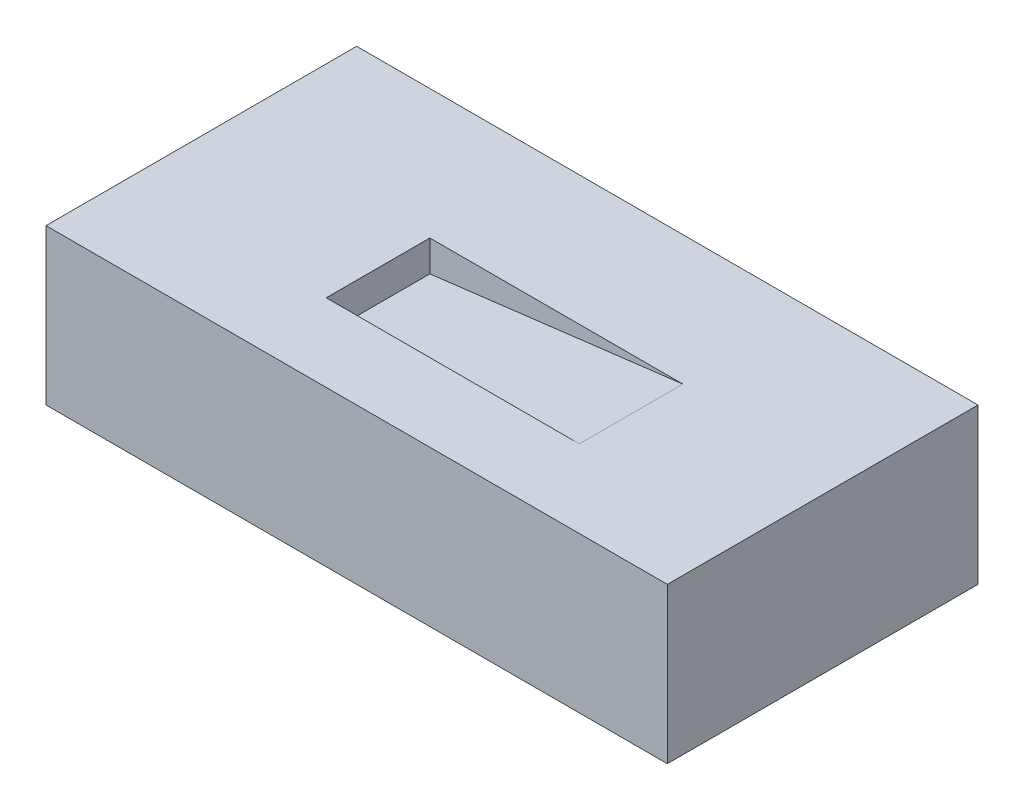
ISO-10303-21;
HEADER;
FILE_DESCRIPTION(('STEP AP214'),'2;1');
FILE_NAME('part.step','',(''),(''),'','','');
FILE_SCHEMA(('AUTOMOTIVE_DESIGN { 1 0 10303 214 1 1 1 1 }'));
ENDSEC;
DATA;
#1=APPLICATION_CONTEXT('core data for automotive mechanical design processes');
#2=APPLICATION_PROTOCOL_DEFINITION('international standard','automotive_design',2000,#1);
#3=PRODUCT_CONTEXT('',#1,'mechanical');
#4=PRODUCT('Part','Part','',(#3));
#5=PRODUCT_RELATED_PRODUCT_CATEGORY('part','',(#4));
#6=PRODUCT_DEFINITION_FORMATION('','',#4);
#7=PRODUCT_DEFINITION_CONTEXT('part definition',#1,'design');
#8=PRODUCT_DEFINITION('design','',#6,#7);
#9=PRODUCT_DEFINITION_SHAPE('','',#8);
#10=(LENGTH_UNIT() NAMED_UNIT(*) SI_UNIT(.MILLI.,.METRE.));
#11=(NAMED_UNIT(*) PLANE_ANGLE_UNIT() SI_UNIT($,.RADIAN.));
#12=(NAMED_UNIT(*) SI_UNIT($,.STERADIAN.) SOLID_ANGLE_UNIT());
#13=UNCERTAINTY_MEASURE_WITH_UNIT(LENGTH_MEASURE(1.E-05),#10,'distance_accuracy_value','');
#14=(GEOMETRIC_REPRESENTATION_CONTEXT(3) GLOBAL_UNCERTAINTY_ASSIGNED_CONTEXT((#13)) GLOBAL_UNIT_ASSIGNED_CONTEXT((#10,
#11,#12)) REPRESENTATION_CONTEXT('',''));
#15=CARTESIAN_POINT('',(0.,0.,0.));
#16=DIRECTION('',(0.,0.,1.));
#17=DIRECTION('',(1.,0.,0.));
#18=AXIS2_PLACEMENT_3D('',#15,#16,#17);
#19=CARTESIAN_POINT('',(0.,0.,-60.));
#20=DIRECTION('',(-1.,0.,0.));
#21=DIRECTION('',(0.,-1.,0.));
#22=AXIS2_PLACEMENT_3D('',#19,#20,#21);
#23=PLANE('',#22);
#24=DIRECTION('',(0.,-1.,0.));
#25=VECTOR('',#24,1.);
#26=CARTESIAN_POINT('',(0.,0.,0.));
#27=LINE('',#26,#25);
#28=CARTESIAN_POINT('',(0.,0.,0.));
#29=VERTEX_POINT('',#28);
#30=CARTESIAN_POINT('',(0.,-30.,0.));
#31=VERTEX_POINT('',#30);
#32=EDGE_CURVE('E128',#29,#31,#27,.T.);
#33=ORIENTED_EDGE('',*,*,#32,.F.);
#34=DIRECTION('',(0.,0.,1.));
#35=VECTOR('',#34,1.);
#36=CARTESIAN_POINT('',(0.,0.,-60.));
#37=LINE('',#36,#35);
#38=CARTESIAN_POINT('',(0.,0.,-60.));
#39=VERTEX_POINT('',#38);
#40=EDGE_CURVE('E11',#39,#29,#37,.T.);
#41=ORIENTED_EDGE('',*,*,#40,.F.);
#42=DIRECTION('',(0.,-1.,0.));
#43=VECTOR('',#42,1.);
#44=CARTESIAN_POINT('',(0.,0.,-60.));
#45=LINE('',#44,#43);
#46=CARTESIAN_POINT('',(0.,-30.,-60.));
#47=VERTEX_POINT('',#46);
#48=EDGE_CURVE('E130',#39,#47,#45,.T.);
#49=ORIENTED_EDGE('',*,*,#48,.T.);
#50=DIRECTION('',(0.,0.,1.));
#51=VECTOR('',#50,1.);
#52=CARTESIAN_POINT('',(0.,-30.,-60.));
#53=LINE('',#52,#51);
#54=EDGE_CURVE('E36',#47,#31,#53,.T.);
#55=ORIENTED_EDGE('',*,*,#54,.T.);
#56=EDGE_LOOP('',(#33,#41,#49,#55));
#57=FACE_BOUND('',#56,.T.);
#58=ADVANCED_FACE('F33',(#57),#23,.T.);
#59=CARTESIAN_POINT('',(0.,0.,-60.));
#60=DIRECTION('',(0.,-1.,0.));
#61=DIRECTION('',(0.,0.,-1.));
#62=AXIS2_PLACEMENT_3D('',#59,#60,#61);
#63=PLANE('',#62);
#64=DIRECTION('',(0.,0.,1.));
#65=VECTOR('',#64,1.);
#66=CARTESIAN_POINT('',(39.1339214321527,0.,-35.));
#67=LINE('',#66,#65);
#68=CARTESIAN_POINT('',(39.1339214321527,0.,-35.));
#69=VERTEX_POINT('',#68);
#70=CARTESIAN_POINT('',(39.1339214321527,0.,-15.));
#71=VERTEX_POINT('',#70);
#72=EDGE_CURVE('E109',#69,#71,#67,.T.);
#73=ORIENTED_EDGE('',*,*,#72,.F.);
#74=DIRECTION('',(-1.,0.,0.));
#75=VECTOR('',#74,1.);
#76=CARTESIAN_POINT('',(-36.3521276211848,0.,-35.));
#77=LINE('',#76,#75);
#78=CARTESIAN_POINT('',(88.,0.,-35.));
#79=VERTEX_POINT('',#78);
#80=EDGE_CURVE('E115',#79,#69,#77,.T.);
#81=ORIENTED_EDGE('',*,*,#80,.F.);
#82=DIRECTION('',(0.,0.,1.));
#83=VECTOR('',#82,1.);
#84=CARTESIAN_POINT('',(88.,0.,-35.));
#85=LINE('',#84,#83);
#86=CARTESIAN_POINT('',(88.,0.,-15.));
#87=VERTEX_POINT('',#86);
#88=EDGE_CURVE('E99',#79,#87,#85,.T.);
#89=ORIENTED_EDGE('',*,*,#88,.T.);
#90=DIRECTION('',(-1.,0.,0.));
#91=VECTOR('',#90,1.);
#92=CARTESIAN_POINT('',(-36.3521276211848,0.,-15.));
#93=LINE('',#92,#91);
#94=EDGE_CURVE('E123',#87,#71,#93,.T.);
#95=ORIENTED_EDGE('',*,*,#94,.T.);
#96=EDGE_LOOP('',(#73,#81,#89,#95));
#97=FACE_BOUND('',#96,.T.);
#98=DIRECTION('',(1.,0.,0.));
#99=VECTOR('',#98,1.);
#100=CARTESIAN_POINT('',(0.,0.,0.));
#101=LINE('',#100,#99);
#102=CARTESIAN_POINT('',(120.,0.,0.));
#103=VERTEX_POINT('',#102);
#104=EDGE_CURVE('E133',#29,#103,#101,.T.);
#105=ORIENTED_EDGE('',*,*,#104,.T.);
#106=DIRECTION('',(0.,0.,1.));
#107=VECTOR('',#106,1.);
#108=CARTESIAN_POINT('',(120.,0.,-60.));
#109=LINE('',#108,#107);
#110=CARTESIAN_POINT('',(120.,0.,-60.));
#111=VERTEX_POINT('',#110);
#112=EDGE_CURVE('E41',#111,#103,#109,.T.);
#113=ORIENTED_EDGE('',*,*,#112,.F.);
#114=DIRECTION('',(1.,0.,0.));
#115=VECTOR('',#114,1.);
#116=CARTESIAN_POINT('',(0.,0.,-60.));
#117=LINE('',#116,#115);
#118=EDGE_CURVE('E137',#39,#111,#117,.T.);
#119=ORIENTED_EDGE('',*,*,#118,.F.);
#120=ORIENTED_EDGE('',*,*,#40,.T.);
#121=EDGE_LOOP('',(#105,#113,#119,#120));
#122=FACE_BOUND('',#121,.T.);
#123=ADVANCED_FACE('F118',(#97,#122),#63,.F.);
#124=CARTESIAN_POINT('',(120.,0.,-60.));
#125=DIRECTION('',(-1.,0.,0.));
#126=DIRECTION('',(0.,-1.,0.));
#127=AXIS2_PLACEMENT_3D('',#124,#125,#126);
#128=PLANE('',#127);
#129=DIRECTION('',(0.,-1.,0.));
#130=VECTOR('',#129,1.);
#131=CARTESIAN_POINT('',(120.,0.,0.));
#132=LINE('',#131,#130);
#133=CARTESIAN_POINT('',(120.,-30.,0.));
#134=VERTEX_POINT('',#133);
#135=EDGE_CURVE('E144',#103,#134,#132,.T.);
#136=ORIENTED_EDGE('',*,*,#135,.T.);
#137=DIRECTION('',(0.,0.,1.));
#138=VECTOR('',#137,1.);
#139=CARTESIAN_POINT('',(120.,-30.,-60.));
#140=LINE('',#139,#138);
#141=CARTESIAN_POINT('',(120.,-30.,-60.));
#142=VERTEX_POINT('',#141);
#143=EDGE_CURVE('E149',#142,#134,#140,.T.);
#144=ORIENTED_EDGE('',*,*,#143,.F.);
#145=DIRECTION('',(0.,-1.,0.));
#146=VECTOR('',#145,1.);
#147=CARTESIAN_POINT('',(120.,0.,-60.));
#148=LINE('',#147,#146);
#149=EDGE_CURVE('E135',#111,#142,#148,.T.);
#150=ORIENTED_EDGE('',*,*,#149,.F.);
#151=ORIENTED_EDGE('',*,*,#112,.T.);
#152=EDGE_LOOP('',(#136,#144,#150,#151));
#153=FACE_BOUND('',#152,.T.);
#154=ADVANCED_FACE('F159',(#153),#128,.F.);
#155=CARTESIAN_POINT('',(0.,-30.,-60.));
#156=DIRECTION('',(0.,-1.,0.));
#157=DIRECTION('',(0.,0.,-1.));
#158=AXIS2_PLACEMENT_3D('',#155,#156,#157);
#159=PLANE('',#158);
#160=DIRECTION('',(1.,0.,0.));
#161=VECTOR('',#160,1.);
#162=CARTESIAN_POINT('',(0.,-30.,0.));
#163=LINE('',#162,#161);
#164=EDGE_CURVE('E141',#31,#134,#163,.T.);
#165=ORIENTED_EDGE('',*,*,#164,.F.);
#166=ORIENTED_EDGE('',*,*,#54,.F.);
#167=DIRECTION('',(1.,0.,0.));
#168=VECTOR('',#167,1.);
#169=CARTESIAN_POINT('',(0.,-30.,-60.));
#170=LINE('',#169,#168);
#171=EDGE_CURVE('E132',#47,#142,#170,.T.);
#172=ORIENTED_EDGE('',*,*,#171,.T.);
#173=ORIENTED_EDGE('',*,*,#143,.T.);
#174=EDGE_LOOP('',(#165,#166,#172,#173));
#175=FACE_BOUND('',#174,.T.);
#176=ADVANCED_FACE('F152',(#175),#159,.T.);
#177=CARTESIAN_POINT('',(0.,-30.,-60.));
#178=DIRECTION('',(0.,0.,1.));
#179=DIRECTION('',(1.,0.,0.));
#180=AXIS2_PLACEMENT_3D('',#177,#178,#179);
#181=PLANE('',#180);
#182=ORIENTED_EDGE('',*,*,#48,.F.);
#183=ORIENTED_EDGE('',*,*,#118,.T.);
#184=ORIENTED_EDGE('',*,*,#149,.T.);
#185=ORIENTED_EDGE('',*,*,#171,.F.);
#186=EDGE_LOOP('',(#182,#183,#184,#185));
#187=FACE_BOUND('',#186,.T.);
#188=ADVANCED_FACE('F161',(#187),#181,.F.);
#189=CARTESIAN_POINT('',(0.,-30.,0.));
#190=DIRECTION('',(0.,0.,1.));
#191=DIRECTION('',(1.,0.,0.));
#192=AXIS2_PLACEMENT_3D('',#189,#190,#191);
#193=PLANE('',#192);
#194=ORIENTED_EDGE('',*,*,#32,.T.);
#195=ORIENTED_EDGE('',*,*,#164,.T.);
#196=ORIENTED_EDGE('',*,*,#135,.F.);
#197=ORIENTED_EDGE('',*,*,#104,.F.);
#198=EDGE_LOOP('',(#194,#195,#196,#197));
#199=FACE_BOUND('',#198,.T.);
#200=ADVANCED_FACE('F155',(#199),#193,.T.);
#201=CARTESIAN_POINT('',(-36.3196470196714,-15.2645332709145,-35.));
#202=DIRECTION('',(-0.121869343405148,0.992546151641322,0.));
#203=DIRECTION('',(-0.992546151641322,-0.121869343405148,0.));
#204=AXIS2_PLACEMENT_3D('',#201,#202,#203);
#205=PLANE('',#204);
#206=DIRECTION('',(-0.992546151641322,-0.121869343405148,0.));
#207=VECTOR('',#206,1.);
#208=CARTESIAN_POINT('',(-36.3196470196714,-15.2645332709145,-15.));
#209=LINE('',#208,#207);
#210=CARTESIAN_POINT('',(39.1339214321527,-6.,-15.));
#211=VERTEX_POINT('',#210);
#212=EDGE_CURVE('E105',#87,#211,#209,.T.);
#213=ORIENTED_EDGE('',*,*,#212,.F.);
#214=ORIENTED_EDGE('',*,*,#88,.F.);
#215=DIRECTION('',(-0.992546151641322,-0.121869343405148,0.));
#216=VECTOR('',#215,1.);
#217=CARTESIAN_POINT('',(-36.3196470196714,-15.2645332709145,-35.));
#218=LINE('',#217,#216);
#219=CARTESIAN_POINT('',(39.1339214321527,-6.,-35.));
#220=VERTEX_POINT('',#219);
#221=EDGE_CURVE('E103',#79,#220,#218,.T.);
#222=ORIENTED_EDGE('',*,*,#221,.T.);
#223=DIRECTION('',(0.,0.,1.));
#224=VECTOR('',#223,1.);
#225=CARTESIAN_POINT('',(39.1339214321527,-6.,-35.));
#226=LINE('',#225,#224);
#227=EDGE_CURVE('E126',#220,#211,#226,.T.);
#228=ORIENTED_EDGE('',*,*,#227,.T.);
#229=EDGE_LOOP('',(#213,#214,#222,#228));
#230=FACE_BOUND('',#229,.T.);
#231=ADVANCED_FACE('F101',(#230),#205,.T.);
#232=CARTESIAN_POINT('',(39.1339214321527,-15.,-35.));
#233=DIRECTION('',(1.,0.,0.));
#234=DIRECTION('',(0.,0.,-1.));
#235=AXIS2_PLACEMENT_3D('',#232,#233,#234);
#236=PLANE('',#235);
#237=DIRECTION('',(0.,1.,0.));
#238=VECTOR('',#237,1.);
#239=CARTESIAN_POINT('',(39.1339214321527,-15.,-15.));
#240=LINE('',#239,#238);
#241=EDGE_CURVE('E49',#211,#71,#240,.T.);
#242=ORIENTED_EDGE('',*,*,#241,.F.);
#243=ORIENTED_EDGE('',*,*,#227,.F.);
#244=DIRECTION('',(0.,1.,0.));
#245=VECTOR('',#244,1.);
#246=CARTESIAN_POINT('',(39.1339214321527,-15.,-35.));
#247=LINE('',#246,#245);
#248=EDGE_CURVE('E110',#220,#69,#247,.T.);
#249=ORIENTED_EDGE('',*,*,#248,.T.);
#250=ORIENTED_EDGE('',*,*,#72,.T.);
#251=EDGE_LOOP('',(#242,#243,#249,#250));
#252=FACE_BOUND('',#251,.T.);
#253=ADVANCED_FACE('F209',(#252),#236,.T.);
#254=CARTESIAN_POINT('',(-36.3521276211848,-15.,-35.));
#255=DIRECTION('',(0.,0.,-1.));
#256=DIRECTION('',(-1.,0.,0.));
#257=AXIS2_PLACEMENT_3D('',#254,#255,#256);
#258=PLANE('',#257);
#259=ORIENTED_EDGE('',*,*,#221,.F.);
#260=ORIENTED_EDGE('',*,*,#80,.T.);
#261=ORIENTED_EDGE('',*,*,#248,.F.);
#262=EDGE_LOOP('',(#259,#260,#261));
#263=FACE_BOUND('',#262,.T.);
#264=ADVANCED_FACE('F114',(#263),#258,.F.);
#265=CARTESIAN_POINT('',(-36.3521276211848,-15.,-15.));
#266=DIRECTION('',(0.,0.,-1.));
#267=DIRECTION('',(-1.,0.,0.));
#268=AXIS2_PLACEMENT_3D('',#265,#266,#267);
#269=PLANE('',#268);
#270=ORIENTED_EDGE('',*,*,#212,.T.);
#271=ORIENTED_EDGE('',*,*,#241,.T.);
#272=ORIENTED_EDGE('',*,*,#94,.F.);
#273=EDGE_LOOP('',(#270,#271,#272));
#274=FACE_BOUND('',#273,.T.);
#275=ADVANCED_FACE('F226',(#274),#269,.T.);
#276=CLOSED_SHELL('',(#58,#123,#154,#176,#188,#200,#231,#253,#264,#275));
#277=MANIFOLD_SOLID_BREP('B2',#276);
#278=ADVANCED_BREP_SHAPE_REPRESENTATION('',(#18,#277),#14);
#279=SHAPE_DEFINITION_REPRESENTATION(#9,#278);
ENDSEC;
END-ISO-10303-21;
